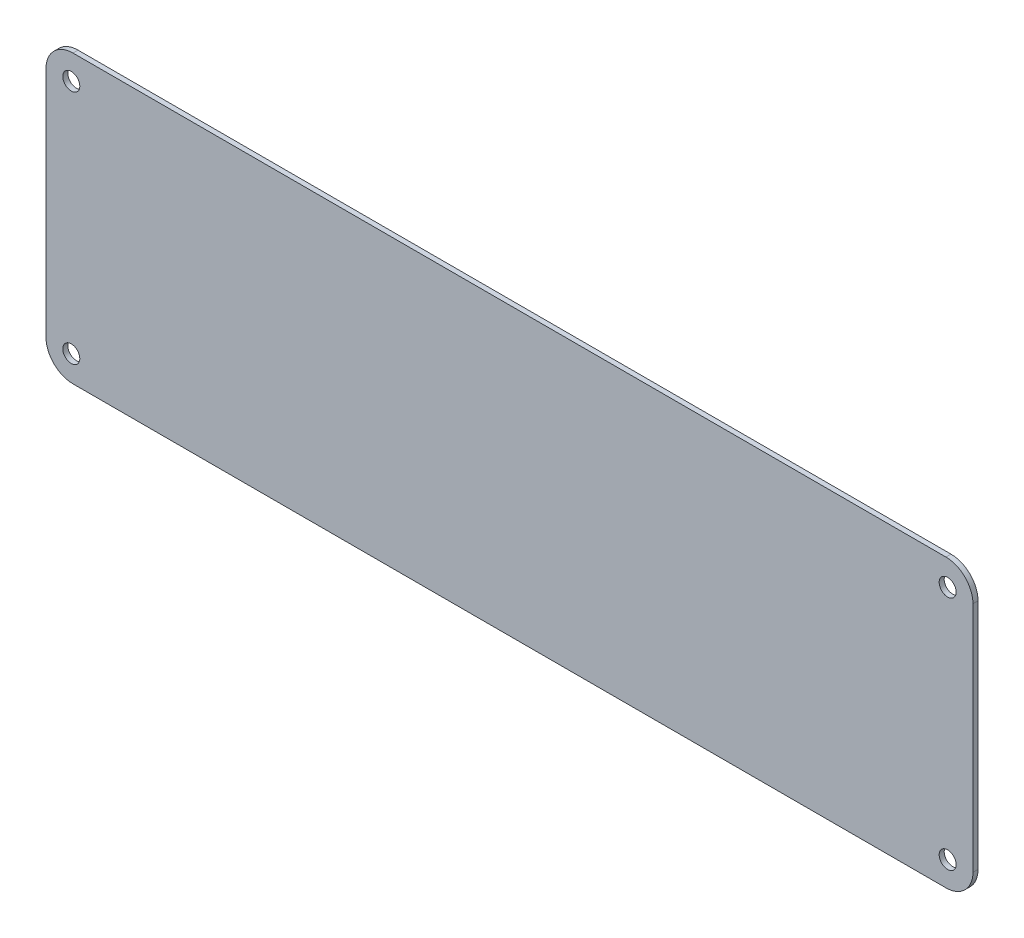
ISO-10303-21;
HEADER;
FILE_DESCRIPTION(('STEP AP214'),'2;1');
FILE_NAME('part.step','',(''),(''),'','','');
FILE_SCHEMA(('AUTOMOTIVE_DESIGN { 1 0 10303 214 1 1 1 1 }'));
ENDSEC;
DATA;
#1=APPLICATION_CONTEXT('core data for automotive mechanical design processes');
#2=APPLICATION_PROTOCOL_DEFINITION('international standard','automotive_design',2000,#1);
#3=PRODUCT_CONTEXT('',#1,'mechanical');
#4=PRODUCT('Part','Part','',(#3));
#5=PRODUCT_RELATED_PRODUCT_CATEGORY('part','',(#4));
#6=PRODUCT_DEFINITION_FORMATION('','',#4);
#7=PRODUCT_DEFINITION_CONTEXT('part definition',#1,'design');
#8=PRODUCT_DEFINITION('design','',#6,#7);
#9=PRODUCT_DEFINITION_SHAPE('','',#8);
#10=(LENGTH_UNIT() NAMED_UNIT(*) SI_UNIT(.MILLI.,.METRE.));
#11=(NAMED_UNIT(*) PLANE_ANGLE_UNIT() SI_UNIT($,.RADIAN.));
#12=(NAMED_UNIT(*) SI_UNIT($,.STERADIAN.) SOLID_ANGLE_UNIT());
#13=UNCERTAINTY_MEASURE_WITH_UNIT(LENGTH_MEASURE(1.E-05),#10,'distance_accuracy_value','');
#14=(GEOMETRIC_REPRESENTATION_CONTEXT(3) GLOBAL_UNCERTAINTY_ASSIGNED_CONTEXT((#13)) GLOBAL_UNIT_ASSIGNED_CONTEXT((#10,
#11,#12)) REPRESENTATION_CONTEXT('',''));
#15=CARTESIAN_POINT('',(0.,0.,0.));
#16=DIRECTION('',(0.,0.,1.));
#17=DIRECTION('',(1.,0.,0.));
#18=AXIS2_PLACEMENT_3D('',#15,#16,#17);
#19=CARTESIAN_POINT('',(137.5,-42.5,1.5));
#20=DIRECTION('',(-1.,0.,0.));
#21=DIRECTION('',(0.,0.,1.));
#22=AXIS2_PLACEMENT_3D('',#19,#20,#21);
#23=PLANE('',#22);
#24=DIRECTION('',(0.,1.,0.));
#25=VECTOR('',#24,1.);
#26=CARTESIAN_POINT('',(137.5,-42.5,1.5));
#27=LINE('',#26,#25);
#28=CARTESIAN_POINT('',(137.5,-34.5,1.5));
#29=VERTEX_POINT('',#28);
#30=CARTESIAN_POINT('',(137.5,34.5,1.5));
#31=VERTEX_POINT('',#30);
#32=EDGE_CURVE('E131',#29,#31,#27,.T.);
#33=ORIENTED_EDGE('',*,*,#32,.F.);
#34=DIRECTION('',(0.,0.,-1.));
#35=VECTOR('',#34,1.);
#36=CARTESIAN_POINT('',(137.5,-34.5,1.5));
#37=LINE('',#36,#35);
#38=CARTESIAN_POINT('',(137.5,-34.5,0.));
#39=VERTEX_POINT('',#38);
#40=EDGE_CURVE('E11',#29,#39,#37,.T.);
#41=ORIENTED_EDGE('',*,*,#40,.T.);
#42=DIRECTION('',(0.,1.,0.));
#43=VECTOR('',#42,1.);
#44=CARTESIAN_POINT('',(137.5,-42.5,0.));
#45=LINE('',#44,#43);
#46=CARTESIAN_POINT('',(137.5,34.5,0.));
#47=VERTEX_POINT('',#46);
#48=EDGE_CURVE('E133',#39,#47,#45,.T.);
#49=ORIENTED_EDGE('',*,*,#48,.T.);
#50=DIRECTION('',(0.,0.,-1.));
#51=VECTOR('',#50,1.);
#52=CARTESIAN_POINT('',(137.5,34.5,1.5));
#53=LINE('',#52,#51);
#54=EDGE_CURVE('E44',#47,#31,#53,.F.);
#55=ORIENTED_EDGE('',*,*,#54,.T.);
#56=EDGE_LOOP('',(#33,#41,#49,#55));
#57=FACE_BOUND('',#56,.T.);
#58=ADVANCED_FACE('F36',(#57),#23,.F.);
#59=CARTESIAN_POINT('',(-137.5,42.5,1.5));
#60=DIRECTION('',(0.,-1.,0.));
#61=DIRECTION('',(0.,0.,-1.));
#62=AXIS2_PLACEMENT_3D('',#59,#60,#61);
#63=PLANE('',#62);
#64=DIRECTION('',(-1.,0.,0.));
#65=VECTOR('',#64,1.);
#66=CARTESIAN_POINT('',(-137.5,42.5,0.));
#67=LINE('',#66,#65);
#68=CARTESIAN_POINT('',(129.5,42.5,0.));
#69=VERTEX_POINT('',#68);
#70=CARTESIAN_POINT('',(-129.5,42.5,0.));
#71=VERTEX_POINT('',#70);
#72=EDGE_CURVE('E129',#69,#71,#67,.T.);
#73=ORIENTED_EDGE('',*,*,#72,.T.);
#74=DIRECTION('',(0.,0.,-1.));
#75=VECTOR('',#74,1.);
#76=CARTESIAN_POINT('',(-129.5,42.5,1.5));
#77=LINE('',#76,#75);
#78=CARTESIAN_POINT('',(-129.5,42.5,1.5));
#79=VERTEX_POINT('',#78);
#80=EDGE_CURVE('E108',#71,#79,#77,.F.);
#81=ORIENTED_EDGE('',*,*,#80,.T.);
#82=DIRECTION('',(-1.,0.,0.));
#83=VECTOR('',#82,1.);
#84=CARTESIAN_POINT('',(-137.5,42.5,1.5));
#85=LINE('',#84,#83);
#86=CARTESIAN_POINT('',(129.5,42.5,1.5));
#87=VERTEX_POINT('',#86);
#88=EDGE_CURVE('E169',#87,#79,#85,.T.);
#89=ORIENTED_EDGE('',*,*,#88,.F.);
#90=DIRECTION('',(0.,0.,-1.));
#91=VECTOR('',#90,1.);
#92=CARTESIAN_POINT('',(129.5,42.5,1.5));
#93=LINE('',#92,#91);
#94=EDGE_CURVE('E113',#87,#69,#93,.T.);
#95=ORIENTED_EDGE('',*,*,#94,.T.);
#96=EDGE_LOOP('',(#73,#81,#89,#95));
#97=FACE_BOUND('',#96,.T.);
#98=ADVANCED_FACE('F173',(#97),#63,.F.);
#99=CARTESIAN_POINT('',(-137.5,-42.5,1.5));
#100=DIRECTION('',(1.,0.,0.));
#101=DIRECTION('',(0.,0.,-1.));
#102=AXIS2_PLACEMENT_3D('',#99,#100,#101);
#103=PLANE('',#102);
#104=DIRECTION('',(0.,-1.,0.));
#105=VECTOR('',#104,1.);
#106=CARTESIAN_POINT('',(-137.5,-42.5,1.5));
#107=LINE('',#106,#105);
#108=CARTESIAN_POINT('',(-137.5,34.5,1.5));
#109=VERTEX_POINT('',#108);
#110=CARTESIAN_POINT('',(-137.5,-34.5,1.5));
#111=VERTEX_POINT('',#110);
#112=EDGE_CURVE('E122',#109,#111,#107,.T.);
#113=ORIENTED_EDGE('',*,*,#112,.F.);
#114=DIRECTION('',(0.,0.,-1.));
#115=VECTOR('',#114,1.);
#116=CARTESIAN_POINT('',(-137.5,34.5,1.5));
#117=LINE('',#116,#115);
#118=CARTESIAN_POINT('',(-137.5,34.5,0.));
#119=VERTEX_POINT('',#118);
#120=EDGE_CURVE('E107',#109,#119,#117,.T.);
#121=ORIENTED_EDGE('',*,*,#120,.T.);
#122=DIRECTION('',(0.,-1.,0.));
#123=VECTOR('',#122,1.);
#124=CARTESIAN_POINT('',(-137.5,-42.5,0.));
#125=LINE('',#124,#123);
#126=CARTESIAN_POINT('',(-137.5,-34.5,0.));
#127=VERTEX_POINT('',#126);
#128=EDGE_CURVE('E120',#119,#127,#125,.T.);
#129=ORIENTED_EDGE('',*,*,#128,.T.);
#130=DIRECTION('',(0.,0.,-1.));
#131=VECTOR('',#130,1.);
#132=CARTESIAN_POINT('',(-137.5,-34.5,1.5));
#133=LINE('',#132,#131);
#134=EDGE_CURVE('E124',#127,#111,#133,.F.);
#135=ORIENTED_EDGE('',*,*,#134,.T.);
#136=EDGE_LOOP('',(#113,#121,#129,#135));
#137=FACE_BOUND('',#136,.T.);
#138=ADVANCED_FACE('F119',(#137),#103,.F.);
#139=CARTESIAN_POINT('',(-137.5,-42.5,1.5));
#140=DIRECTION('',(0.,1.,0.));
#141=DIRECTION('',(0.,0.,1.));
#142=AXIS2_PLACEMENT_3D('',#139,#140,#141);
#143=PLANE('',#142);
#144=DIRECTION('',(1.,0.,0.));
#145=VECTOR('',#144,1.);
#146=CARTESIAN_POINT('',(-137.5,-42.5,1.5));
#147=LINE('',#146,#145);
#148=CARTESIAN_POINT('',(-129.5,-42.5,1.5));
#149=VERTEX_POINT('',#148);
#150=CARTESIAN_POINT('',(129.5,-42.5,1.5));
#151=VERTEX_POINT('',#150);
#152=EDGE_CURVE('E137',#149,#151,#147,.T.);
#153=ORIENTED_EDGE('',*,*,#152,.F.);
#154=DIRECTION('',(0.,0.,-1.));
#155=VECTOR('',#154,1.);
#156=CARTESIAN_POINT('',(-129.5,-42.5,1.5));
#157=LINE('',#156,#155);
#158=CARTESIAN_POINT('',(-129.5,-42.5,0.));
#159=VERTEX_POINT('',#158);
#160=EDGE_CURVE('E154',#149,#159,#157,.T.);
#161=ORIENTED_EDGE('',*,*,#160,.T.);
#162=DIRECTION('',(1.,0.,0.));
#163=VECTOR('',#162,1.);
#164=CARTESIAN_POINT('',(-137.5,-42.5,0.));
#165=LINE('',#164,#163);
#166=CARTESIAN_POINT('',(129.5,-42.5,0.));
#167=VERTEX_POINT('',#166);
#168=EDGE_CURVE('E128',#159,#167,#165,.T.);
#169=ORIENTED_EDGE('',*,*,#168,.T.);
#170=DIRECTION('',(0.,0.,-1.));
#171=VECTOR('',#170,1.);
#172=CARTESIAN_POINT('',(129.5,-42.5,1.5));
#173=LINE('',#172,#171);
#174=EDGE_CURVE('E51',#167,#151,#173,.F.);
#175=ORIENTED_EDGE('',*,*,#174,.T.);
#176=EDGE_LOOP('',(#153,#161,#169,#175));
#177=FACE_BOUND('',#176,.T.);
#178=ADVANCED_FACE('F207',(#177),#143,.F.);
#179=CARTESIAN_POINT('',(0.,0.,1.5));
#180=DIRECTION('',(0.,0.,-1.));
#181=DIRECTION('',(-1.,0.,0.));
#182=AXIS2_PLACEMENT_3D('',#179,#180,#181);
#183=PLANE('',#182);
#184=CARTESIAN_POINT('',(130.,35.,1.5));
#185=DIRECTION('',(0.,0.,1.));
#186=DIRECTION('',(1.,0.,0.));
#187=AXIS2_PLACEMENT_3D('',#184,#185,#186);
#188=CIRCLE('',#187,2.525);
#189=CARTESIAN_POINT('',(132.525,35.,1.5));
#190=VERTEX_POINT('',#189);
#191=EDGE_CURVE('E199',#190,#190,#188,.T.);
#192=ORIENTED_EDGE('',*,*,#191,.F.);
#193=EDGE_LOOP('',(#192));
#194=FACE_BOUND('',#193,.T.);
#195=CARTESIAN_POINT('',(-130.,-35.,1.5));
#196=DIRECTION('',(0.,0.,1.));
#197=DIRECTION('',(1.,0.,0.));
#198=AXIS2_PLACEMENT_3D('',#195,#196,#197);
#199=CIRCLE('',#198,2.525);
#200=CARTESIAN_POINT('',(-127.475,-35.,1.5));
#201=VERTEX_POINT('',#200);
#202=EDGE_CURVE('E193',#201,#201,#199,.T.);
#203=ORIENTED_EDGE('',*,*,#202,.F.);
#204=EDGE_LOOP('',(#203));
#205=FACE_BOUND('',#204,.T.);
#206=CARTESIAN_POINT('',(-130.,35.,1.5));
#207=DIRECTION('',(0.,0.,1.));
#208=DIRECTION('',(1.,0.,0.));
#209=AXIS2_PLACEMENT_3D('',#206,#207,#208);
#210=CIRCLE('',#209,2.525);
#211=CARTESIAN_POINT('',(-127.475,35.,1.5));
#212=VERTEX_POINT('',#211);
#213=EDGE_CURVE('E187',#212,#212,#210,.T.);
#214=ORIENTED_EDGE('',*,*,#213,.F.);
#215=EDGE_LOOP('',(#214));
#216=FACE_BOUND('',#215,.T.);
#217=CARTESIAN_POINT('',(130.,-35.,1.5));
#218=DIRECTION('',(0.,0.,1.));
#219=DIRECTION('',(1.,0.,0.));
#220=AXIS2_PLACEMENT_3D('',#217,#218,#219);
#221=CIRCLE('',#220,2.525);
#222=CARTESIAN_POINT('',(132.525,-35.,1.5));
#223=VERTEX_POINT('',#222);
#224=EDGE_CURVE('E176',#223,#223,#221,.T.);
#225=ORIENTED_EDGE('',*,*,#224,.F.);
#226=EDGE_LOOP('',(#225));
#227=FACE_BOUND('',#226,.T.);
#228=ORIENTED_EDGE('',*,*,#88,.T.);
#229=CARTESIAN_POINT('',(-129.5,34.5,1.5));
#230=DIRECTION('',(0.,0.,-1.));
#231=DIRECTION('',(-1.,0.,0.));
#232=AXIS2_PLACEMENT_3D('',#229,#230,#231);
#233=CIRCLE('',#232,8.);
#234=EDGE_CURVE('E151',#79,#109,#233,.F.);
#235=ORIENTED_EDGE('',*,*,#234,.T.);
#236=ORIENTED_EDGE('',*,*,#112,.T.);
#237=CARTESIAN_POINT('',(-129.5,-34.5,1.5));
#238=DIRECTION('',(0.,0.,-1.));
#239=DIRECTION('',(-1.,0.,0.));
#240=AXIS2_PLACEMENT_3D('',#237,#238,#239);
#241=CIRCLE('',#240,8.);
#242=EDGE_CURVE('E58',#111,#149,#241,.F.);
#243=ORIENTED_EDGE('',*,*,#242,.T.);
#244=ORIENTED_EDGE('',*,*,#152,.T.);
#245=CARTESIAN_POINT('',(129.5,-34.5,1.5));
#246=DIRECTION('',(0.,0.,-1.));
#247=DIRECTION('',(-1.,0.,0.));
#248=AXIS2_PLACEMENT_3D('',#245,#246,#247);
#249=CIRCLE('',#248,8.);
#250=EDGE_CURVE('E148',#151,#29,#249,.F.);
#251=ORIENTED_EDGE('',*,*,#250,.T.);
#252=ORIENTED_EDGE('',*,*,#32,.T.);
#253=CARTESIAN_POINT('',(129.5,34.5,1.5));
#254=DIRECTION('',(0.,0.,-1.));
#255=DIRECTION('',(-1.,0.,0.));
#256=AXIS2_PLACEMENT_3D('',#253,#254,#255);
#257=CIRCLE('',#256,8.);
#258=EDGE_CURVE('E146',#31,#87,#257,.F.);
#259=ORIENTED_EDGE('',*,*,#258,.T.);
#260=EDGE_LOOP('',(#228,#235,#236,#243,#244,#251,#252,#259));
#261=FACE_BOUND('',#260,.T.);
#262=ADVANCED_FACE('F166',(#194,#205,#216,#227,#261),#183,.F.);
#263=CARTESIAN_POINT('',(0.,0.,0.));
#264=DIRECTION('',(0.,0.,-1.));
#265=DIRECTION('',(-1.,0.,0.));
#266=AXIS2_PLACEMENT_3D('',#263,#264,#265);
#267=PLANE('',#266);
#268=CARTESIAN_POINT('',(130.,35.,0.));
#269=DIRECTION('',(0.,0.,1.));
#270=DIRECTION('',(1.,0.,0.));
#271=AXIS2_PLACEMENT_3D('',#268,#269,#270);
#272=CIRCLE('',#271,2.525);
#273=CARTESIAN_POINT('',(132.525,35.,0.));
#274=VERTEX_POINT('',#273);
#275=EDGE_CURVE('E196',#274,#274,#272,.T.);
#276=ORIENTED_EDGE('',*,*,#275,.T.);
#277=EDGE_LOOP('',(#276));
#278=FACE_BOUND('',#277,.T.);
#279=CARTESIAN_POINT('',(-130.,-35.,0.));
#280=DIRECTION('',(0.,0.,1.));
#281=DIRECTION('',(1.,0.,0.));
#282=AXIS2_PLACEMENT_3D('',#279,#280,#281);
#283=CIRCLE('',#282,2.525);
#284=CARTESIAN_POINT('',(-127.475,-35.,0.));
#285=VERTEX_POINT('',#284);
#286=EDGE_CURVE('E190',#285,#285,#283,.T.);
#287=ORIENTED_EDGE('',*,*,#286,.T.);
#288=EDGE_LOOP('',(#287));
#289=FACE_BOUND('',#288,.T.);
#290=CARTESIAN_POINT('',(-130.,35.,0.));
#291=DIRECTION('',(0.,0.,1.));
#292=DIRECTION('',(1.,0.,0.));
#293=AXIS2_PLACEMENT_3D('',#290,#291,#292);
#294=CIRCLE('',#293,2.525);
#295=CARTESIAN_POINT('',(-127.475,35.,0.));
#296=VERTEX_POINT('',#295);
#297=EDGE_CURVE('E184',#296,#296,#294,.T.);
#298=ORIENTED_EDGE('',*,*,#297,.T.);
#299=EDGE_LOOP('',(#298));
#300=FACE_BOUND('',#299,.T.);
#301=CARTESIAN_POINT('',(130.,-35.,0.));
#302=DIRECTION('',(0.,0.,1.));
#303=DIRECTION('',(1.,0.,0.));
#304=AXIS2_PLACEMENT_3D('',#301,#302,#303);
#305=CIRCLE('',#304,2.525);
#306=CARTESIAN_POINT('',(132.525,-35.,0.));
#307=VERTEX_POINT('',#306);
#308=EDGE_CURVE('E174',#307,#307,#305,.T.);
#309=ORIENTED_EDGE('',*,*,#308,.T.);
#310=EDGE_LOOP('',(#309));
#311=FACE_BOUND('',#310,.T.);
#312=ORIENTED_EDGE('',*,*,#128,.F.);
#313=CARTESIAN_POINT('',(-129.5,34.5,0.));
#314=DIRECTION('',(0.,0.,-1.));
#315=DIRECTION('',(-1.,0.,0.));
#316=AXIS2_PLACEMENT_3D('',#313,#314,#315);
#317=CIRCLE('',#316,8.);
#318=EDGE_CURVE('E103',#119,#71,#317,.T.);
#319=ORIENTED_EDGE('',*,*,#318,.T.);
#320=ORIENTED_EDGE('',*,*,#72,.F.);
#321=CARTESIAN_POINT('',(129.5,34.5,0.));
#322=DIRECTION('',(0.,0.,-1.));
#323=DIRECTION('',(-1.,0.,0.));
#324=AXIS2_PLACEMENT_3D('',#321,#322,#323);
#325=CIRCLE('',#324,8.);
#326=EDGE_CURVE('E123',#69,#47,#325,.T.);
#327=ORIENTED_EDGE('',*,*,#326,.T.);
#328=ORIENTED_EDGE('',*,*,#48,.F.);
#329=CARTESIAN_POINT('',(129.5,-34.5,0.));
#330=DIRECTION('',(0.,0.,-1.));
#331=DIRECTION('',(-1.,0.,0.));
#332=AXIS2_PLACEMENT_3D('',#329,#330,#331);
#333=CIRCLE('',#332,8.);
#334=EDGE_CURVE('E140',#39,#167,#333,.T.);
#335=ORIENTED_EDGE('',*,*,#334,.T.);
#336=ORIENTED_EDGE('',*,*,#168,.F.);
#337=CARTESIAN_POINT('',(-129.5,-34.5,0.));
#338=DIRECTION('',(0.,0.,-1.));
#339=DIRECTION('',(-1.,0.,0.));
#340=AXIS2_PLACEMENT_3D('',#337,#338,#339);
#341=CIRCLE('',#340,8.);
#342=EDGE_CURVE('E114',#159,#127,#341,.T.);
#343=ORIENTED_EDGE('',*,*,#342,.T.);
#344=EDGE_LOOP('',(#312,#319,#320,#327,#328,#335,#336,#343));
#345=FACE_BOUND('',#344,.T.);
#346=ADVANCED_FACE('F126',(#278,#289,#300,#311,#345),#267,.T.);
#347=CARTESIAN_POINT('',(130.,-35.,1.5));
#348=DIRECTION('',(0.,0.,1.));
#349=DIRECTION('',(1.,0.,0.));
#350=AXIS2_PLACEMENT_3D('',#347,#348,#349);
#351=CYLINDRICAL_SURFACE('',#350,2.525);
#352=ORIENTED_EDGE('',*,*,#308,.F.);
#353=EDGE_LOOP('',(#352));
#354=FACE_BOUND('',#353,.T.);
#355=ORIENTED_EDGE('',*,*,#224,.T.);
#356=EDGE_LOOP('',(#355));
#357=FACE_BOUND('',#356,.T.);
#358=ADVANCED_FACE('F215',(#354,#357),#351,.F.);
#359=CARTESIAN_POINT('',(-130.,35.,1.5));
#360=DIRECTION('',(0.,0.,1.));
#361=DIRECTION('',(1.,0.,0.));
#362=AXIS2_PLACEMENT_3D('',#359,#360,#361);
#363=CYLINDRICAL_SURFACE('',#362,2.525);
#364=ORIENTED_EDGE('',*,*,#297,.F.);
#365=EDGE_LOOP('',(#364));
#366=FACE_BOUND('',#365,.T.);
#367=ORIENTED_EDGE('',*,*,#213,.T.);
#368=EDGE_LOOP('',(#367));
#369=FACE_BOUND('',#368,.T.);
#370=ADVANCED_FACE('F217',(#366,#369),#363,.F.);
#371=CARTESIAN_POINT('',(-130.,-35.,1.5));
#372=DIRECTION('',(0.,0.,1.));
#373=DIRECTION('',(1.,0.,0.));
#374=AXIS2_PLACEMENT_3D('',#371,#372,#373);
#375=CYLINDRICAL_SURFACE('',#374,2.525);
#376=ORIENTED_EDGE('',*,*,#286,.F.);
#377=EDGE_LOOP('',(#376));
#378=FACE_BOUND('',#377,.T.);
#379=ORIENTED_EDGE('',*,*,#202,.T.);
#380=EDGE_LOOP('',(#379));
#381=FACE_BOUND('',#380,.T.);
#382=ADVANCED_FACE('F224',(#378,#381),#375,.F.);
#383=CARTESIAN_POINT('',(130.,35.,1.5));
#384=DIRECTION('',(0.,0.,1.));
#385=DIRECTION('',(1.,0.,0.));
#386=AXIS2_PLACEMENT_3D('',#383,#384,#385);
#387=CYLINDRICAL_SURFACE('',#386,2.525);
#388=ORIENTED_EDGE('',*,*,#275,.F.);
#389=EDGE_LOOP('',(#388));
#390=FACE_BOUND('',#389,.T.);
#391=ORIENTED_EDGE('',*,*,#191,.T.);
#392=EDGE_LOOP('',(#391));
#393=FACE_BOUND('',#392,.T.);
#394=ADVANCED_FACE('F203',(#390,#393),#387,.F.);
#395=CARTESIAN_POINT('',(-129.5,34.5,1.5));
#396=DIRECTION('',(0.,0.,-1.));
#397=DIRECTION('',(-1.,0.,0.));
#398=AXIS2_PLACEMENT_3D('',#395,#396,#397);
#399=CYLINDRICAL_SURFACE('',#398,8.);
#400=ORIENTED_EDGE('',*,*,#234,.F.);
#401=ORIENTED_EDGE('',*,*,#80,.F.);
#402=ORIENTED_EDGE('',*,*,#318,.F.);
#403=ORIENTED_EDGE('',*,*,#120,.F.);
#404=EDGE_LOOP('',(#400,#401,#402,#403));
#405=FACE_BOUND('',#404,.T.);
#406=ADVANCED_FACE('F106',(#405),#399,.T.);
#407=CARTESIAN_POINT('',(-129.5,-34.5,1.5));
#408=DIRECTION('',(0.,0.,-1.));
#409=DIRECTION('',(-1.,0.,0.));
#410=AXIS2_PLACEMENT_3D('',#407,#408,#409);
#411=CYLINDRICAL_SURFACE('',#410,8.);
#412=ORIENTED_EDGE('',*,*,#242,.F.);
#413=ORIENTED_EDGE('',*,*,#134,.F.);
#414=ORIENTED_EDGE('',*,*,#342,.F.);
#415=ORIENTED_EDGE('',*,*,#160,.F.);
#416=EDGE_LOOP('',(#412,#413,#414,#415));
#417=FACE_BOUND('',#416,.T.);
#418=ADVANCED_FACE('F240',(#417),#411,.T.);
#419=CARTESIAN_POINT('',(129.5,-34.5,1.5));
#420=DIRECTION('',(0.,0.,-1.));
#421=DIRECTION('',(-1.,0.,0.));
#422=AXIS2_PLACEMENT_3D('',#419,#420,#421);
#423=CYLINDRICAL_SURFACE('',#422,8.);
#424=ORIENTED_EDGE('',*,*,#250,.F.);
#425=ORIENTED_EDGE('',*,*,#174,.F.);
#426=ORIENTED_EDGE('',*,*,#334,.F.);
#427=ORIENTED_EDGE('',*,*,#40,.F.);
#428=EDGE_LOOP('',(#424,#425,#426,#427));
#429=FACE_BOUND('',#428,.T.);
#430=ADVANCED_FACE('F242',(#429),#423,.T.);
#431=CARTESIAN_POINT('',(129.5,34.5,1.5));
#432=DIRECTION('',(0.,0.,-1.));
#433=DIRECTION('',(-1.,0.,0.));
#434=AXIS2_PLACEMENT_3D('',#431,#432,#433);
#435=CYLINDRICAL_SURFACE('',#434,8.);
#436=ORIENTED_EDGE('',*,*,#258,.F.);
#437=ORIENTED_EDGE('',*,*,#54,.F.);
#438=ORIENTED_EDGE('',*,*,#326,.F.);
#439=ORIENTED_EDGE('',*,*,#94,.F.);
#440=EDGE_LOOP('',(#436,#437,#438,#439));
#441=FACE_BOUND('',#440,.T.);
#442=ADVANCED_FACE('F38',(#441),#435,.T.);
#443=CLOSED_SHELL('',(#58,#98,#138,#178,#262,#346,#358,#370,#382,#394,#406,#418,#430,#442));
#444=MANIFOLD_SOLID_BREP('B2',#443);
#445=ADVANCED_BREP_SHAPE_REPRESENTATION('',(#18,#444),#14);
#446=SHAPE_DEFINITION_REPRESENTATION(#9,#445);
ENDSEC;
END-ISO-10303-21;
